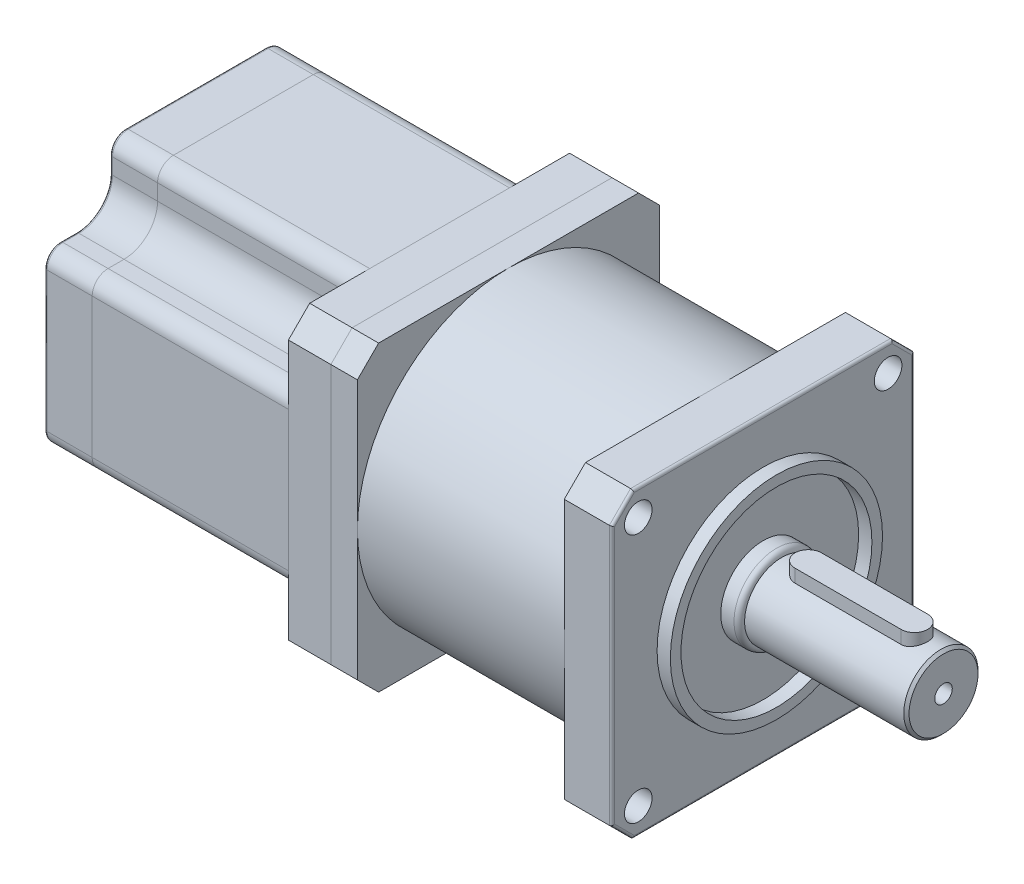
from build123d import *

# Parameters (mm, degrees)
EXTRUDE_1_DEPTH     = 9
SKETCH_2_R          = 28.5
EXTRUDE_2_DEPTH     = 39
EXTRUDE_3_DEPTH     = 5
EXTRUDE_4_DEPTH     = 8
EXTRUDE_5_DEPTH     = 37
EXTRUDE_6_DEPTH     = 9
CUT_EXTRUDE_1_DEPTH = 46
FILLET_1_R          = 0.5
FILLET_2_R          = 0.5
SKETCH_8_R          = 2.6
CUT_EXTRUDE_2_DEPTH = 9
SKETCH_9_R          = 20
SKETCH_9_R_2        = 18
EXTRUDE_7_DEPTH     = 2.5
SKETCH_10_R         = 8
EXTRUDE_8_DEPTH     = 3.5
FILLET_3_R          = 1
SKETCH_11_R         = 7
EXTRUDE_9_DEPTH     = 30.5
CUT_EXTRUDE_3_DEPTH = 3
EXTRUDE_10_DEPTH    = 5
CHAMFER_1_SIZE      = 0.5


with BuildPart() as part:
    # Sketch 1 → Extrude 1 (new body)
    with BuildSketch(Plane(origin=(0, 0, 0), x_dir=(0, 0, -1), z_dir=(1, 0, 0))):
        Polygon((-28.5, 24.5), (-24.5, 28.5), (24.5, 28.5), (28.5, 24.5), (28.5, -24.5), (24.5, -28.5), (-24.5, -28.5), (-28.5, -24.5), align=None)
    extrude(amount=-EXTRUDE_1_DEPTH)

    # Sketch 2 → Extrude 2 (add)
    with BuildSketch(Plane.ZY.offset(9)):
        Circle(SKETCH_2_R)
    extrude(amount=EXTRUDE_2_DEPTH)

    # Sketch 3 → Extrude 3 (add)
    with BuildSketch(Plane.ZY.offset(48)):
        Polygon((-24.5, -28.5), (24.5, -28.5), (28.5, -24.5), (28.5, 24.5), (24.5, 28.5), (-24.5, 28.5), (-28.5, 24.5), (-28.5, -24.5), align=None)
    extrude(amount=EXTRUDE_3_DEPTH)

    # Fillet 2
    fillet_2_edges = [part.edges().sort_by_distance(p)[0] for p in [
        (0, 26.5, 26.5),
        (0, 28.5, 0),
        (0, 26.5, -26.5),
        (0, 0, -28.5),
        (0, -26.5, -26.5),
        (0, -28.5, 0),
        (0, -26.5, 26.5),
        (0, 0, 28.5),
    ]]
    fillet(fillet_2_edges, radius=FILLET_2_R)

    # Sketch 8 → Cut-Extrude 2 (cut)
    with BuildSketch(Plane(origin=(0, 0, 0), x_dir=(0, 0, -1), z_dir=(1, 0, 0))):
        with Locations((-23.55, 23.55)):
            Circle(SKETCH_8_R)
        with Locations((23.55, 23.55)):
            Circle(SKETCH_8_R)
        with Locations((23.55, -23.55)):
            Circle(SKETCH_8_R)
        with Locations((-23.55, -23.55)):
            Circle(SKETCH_8_R)
    extrude(amount=-CUT_EXTRUDE_2_DEPTH, mode=Mode.SUBTRACT)

    # Sketch 9 → Extrude 7 (add)
    with BuildSketch(Plane(origin=(0, 0, 0), x_dir=(0, 0, -1), z_dir=(1, 0, 0))):
        Circle(SKETCH_9_R)
        Circle(SKETCH_9_R_2, mode=Mode.SUBTRACT)
    extrude(amount=EXTRUDE_7_DEPTH)

    # Sketch 10 → Extrude 8 (add)
    with BuildSketch(Plane(origin=(0, 0, 0), x_dir=(0, 0, -1), z_dir=(1, 0, 0))):
        Circle(SKETCH_10_R)
    extrude(amount=EXTRUDE_8_DEPTH)

    # Fillet 3
    fillet_3_edges = [part.edges().sort_by_distance(p)[0] for p in [
        (3.5, 0, 8),
    ]]
    fillet(fillet_3_edges, radius=FILLET_3_R)


with BuildPart() as body_2:
    # Sketch 4 → Extrude 4 (new body)
    with BuildSketch(Plane.ZY.offset(53)):
        Polygon((-24.5, -28.5), (24.5, -28.5), (28.5, -24.5), (28.5, 24.5), (24.5, 28.5), (-24.5, 28.5), (-28.5, 24.5), (-28.5, -24.5), align=None)
    extrude(amount=EXTRUDE_4_DEPTH)


with BuildPart() as body_3:
    # Sketch 5 → Extrude 5 (new body)
    with BuildSketch(Plane.ZY.offset(61)):
        Polygon((-24.5, -28.5), (24.5, -28.5), (28.5, -24.5), (28.5, 24.5), (24.5, 28.5), (-24.5, 28.5), (-28.5, 24.5), (-28.5, -24.5), align=None)
    extrude(amount=EXTRUDE_5_DEPTH)


with BuildPart() as body_4:
    # Sketch 6 → Extrude 6 (new body)
    with BuildSketch(Plane.ZY.offset(98)):
        Polygon((-24.5, -28.5), (24.5, -28.5), (28.5, -24.5), (28.5, 24.5), (24.5, 28.5), (-24.5, 28.5), (-28.5, 24.5), (-28.5, -24.5), align=None)
    extrude(amount=EXTRUDE_6_DEPTH)


with BuildPart() as cut_extrude_1_tool:
    # Sketch 7 → Cut-Extrude 1 (new body)
    with BuildSketch(Plane.ZY.offset(107)):
        with BuildLine():
            Line((-22.5, 16.17544468), (-25.5, 16.17544468))
            ThreePointArc((-25.5, 16.17544468), (-27.621320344, 15.296765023), (-28.5, 13.17544468))
            Line((-28.5, 13.17544468), (-28.5, 24.5))
            Line((-28.5, 24.5), (-24.5, 28.5))
            Line((-24.5, 28.5), (-13.17544468, 28.5))
            ThreePointArc((-13.17544468, 28.5), (-15.296765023, 27.621320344), (-16.17544468, 25.5))
            Line((-16.17544468, 25.5), (-16.17544468, 22.5))
            ThreePointArc((-16.17544468, 22.5), (-18.027864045, 18.027864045), (-22.5, 16.17544468))
        make_face()
        with BuildLine():
            Line((13.17544468, 28.5), (24.5, 28.5))
            Line((24.5, 28.5), (28.5, 24.5))
            Line((28.5, 24.5), (28.5, 13.17544468))
            ThreePointArc((28.5, 13.17544468), (27.621320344, 15.296765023), (25.5, 16.17544468))
            Line((25.5, 16.17544468), (22.5, 16.17544468))
            ThreePointArc((22.5, 16.17544468), (18.027864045, 18.027864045), (16.17544468, 22.5))
            Line((16.17544468, 22.5), (16.17544468, 25.5))
            ThreePointArc((16.17544468, 25.5), (15.296765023, 27.621320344), (13.17544468, 28.5))
        make_face()
        with BuildLine():
            Line((-25.5, -16.17544468), (-22.5, -16.17544468))
            ThreePointArc((-22.5, -16.17544468), (-18.027864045, -18.027864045), (-16.17544468, -22.5))
            Line((-16.17544468, -22.5), (-16.17544468, -25.5))
            ThreePointArc((-16.17544468, -25.5), (-15.296765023, -27.621320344), (-13.17544468, -28.5))
            Line((-13.17544468, -28.5), (-24.5, -28.5))
            Line((-24.5, -28.5), (-28.5, -24.5))
            Line((-28.5, -24.5), (-28.5, -13.17544468))
            ThreePointArc((-28.5, -13.17544468), (-27.621320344, -15.296765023), (-25.5, -16.17544468))
        make_face()
        with BuildLine():
            Line((28.5, -13.17544468), (28.5, -24.5))
            Line((28.5, -24.5), (24.5, -28.5))
            Line((24.5, -28.5), (13.17544468, -28.5))
            ThreePointArc((13.17544468, -28.5), (15.296765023, -27.621320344), (16.17544468, -25.5))
            Line((16.17544468, -25.5), (16.17544468, -22.5))
            ThreePointArc((16.17544468, -22.5), (18.027864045, -18.027864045), (22.5, -16.17544468))
            Line((22.5, -16.17544468), (25.5, -16.17544468))
            ThreePointArc((25.5, -16.17544468), (27.621320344, -15.296765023), (28.5, -13.17544468))
        make_face()
    extrude(amount=-CUT_EXTRUDE_1_DEPTH)


with BuildPart() as body_3_1:
    add(body_3.part)

    # Cut-Extrude 1: cut by cut_extrude_1_tool
    add(cut_extrude_1_tool.part, mode=Mode.SUBTRACT)


with BuildPart() as body_4_1:
    add(body_4.part)

    # Cut-Extrude 1: cut by cut_extrude_1_tool
    add(cut_extrude_1_tool.part, mode=Mode.SUBTRACT)

    # Fillet 1
    fillet_1_edges = [body_4_1.edges().sort_by_distance(p)[0] for p in [
        (-107, 18.027864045, 18.027864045),
        (-107, 16.17544468, 24),
        (-107, 15.296765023, 27.621320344),
        (-107, 27.621320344, 15.296765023),
        (-107, 24, 16.17544468),
        (-107, 0, -28.5),
        (-107, -28.5, 0),
        (-107, 0, 28.5),
        (-107, 28.5, 0),
        (-107, 27.621320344, -15.296765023),
        (-107, 15.296765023, -27.621320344),
        (-107, 16.17544468, -24),
        (-107, 18.027864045, -18.027864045),
        (-107, 24, -16.17544468),
        (-107, -18.027864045, -18.027864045),
        (-107, -16.17544468, -24),
        (-107, -15.296765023, -27.621320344),
        (-107, -27.621320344, -15.296765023),
        (-107, -24, -16.17544468),
        (-107, -18.027864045, 18.027864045),
        (-107, -24, 16.17544468),
        (-107, -27.621320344, 15.296765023),
        (-107, -15.296765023, 27.621320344),
        (-107, -16.17544468, 24),
    ]]
    fillet(fillet_1_edges, radius=FILLET_1_R)


with BuildPart() as body_5:
    # Sketch 11 → Extrude 9 (new body)
    with BuildSketch(Plane(origin=(3.5, 0, 0), x_dir=(0, 0, -1), z_dir=(1, 0, 0))):
        with Locations(Location((0, 0, 0), (0, 0, 180))):
            Circle(SKETCH_11_R)
    extrude(amount=EXTRUDE_9_DEPTH)

    # Sketch 12 → Cut-Extrude 3 (cut)
    with BuildSketch(Plane(origin=(0, 7, 0), x_dir=(1, 0, 0), z_dir=(0, 1, 0))):
        with BuildLine():
            Line((8.5, 2.5), (28.5, 2.5))
            ThreePointArc((28.5, 2.5), (31, 0), (28.5, -2.5))
            Line((28.5, -2.5), (8.5, -2.5))
            ThreePointArc((8.5, -2.5), (6, 0), (8.5, 2.5))
        make_face()
    extrude(amount=-CUT_EXTRUDE_3_DEPTH, mode=Mode.SUBTRACT)

    # Chamfer 1
    chamfer_1_edges = [body_5.edges().sort_by_distance(p)[0] for p in [
        (34, 0, -7),
    ]]
    chamfer(chamfer_1_edges, length=CHAMFER_1_SIZE)

    # Sketch 16 → Hole Wizard M4 _1 (revolve, cut)
    with BuildSketch(Plane(origin=(34, 0, 0), x_dir=(0, 0, -1), z_dir=(0, 1, 0))):
        Polygon((0, 0), (0, 10.491420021), (1.65, 9.5), (1.65, 0), align=None)
    revolve(axis=Axis((40.35, 0, 0), (-1, 0, 0)), mode=Mode.SUBTRACT)


with BuildPart() as body_6:
    # Sketch 13 → Extrude 10 (new body)
    with BuildSketch(Plane(origin=(0, 4, 0), x_dir=(1, 0, 0), z_dir=(0, 1, 0))):
        with BuildLine():
            Line((28.5, 2.5), (8.5, 2.5))
            ThreePointArc((8.5, 2.5), (6, 0), (8.5, -2.5))
            Line((8.5, -2.5), (28.5, -2.5))
            ThreePointArc((28.5, -2.5), (31, 0), (28.5, 2.5))
        make_face()
    extrude(amount=EXTRUDE_10_DEPTH)


solid = Compound([part.part, body_2.part, body_3_1.part, body_4_1.part, body_5.part, body_6.part])
